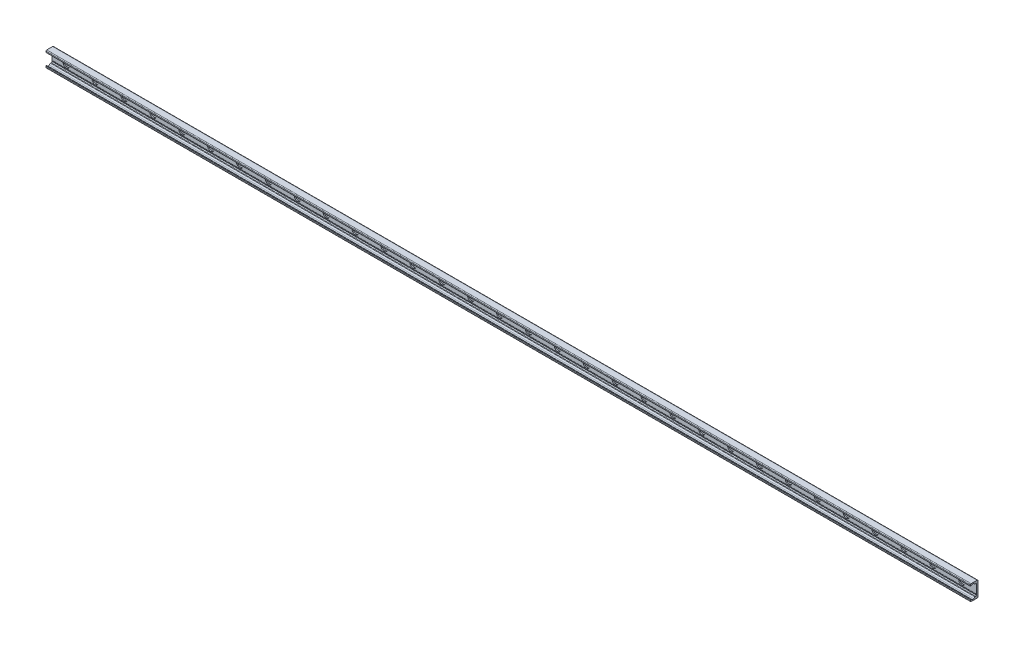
from build123d import *

# Parameters (mm, degrees)
BOSS_EXTRUDE1_DEPTH = 1280
SKETCH2_R           = 9
SKETCH2_R_2         = 4.5
CUT_EXTRUDE1_DEPTH  = 3.1
SKETCH2_2_R         = 4.5
CUT_EXTRUDE2_DEPTH  = 1281.286881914
LPATTERN1_COUNT     = 32
LPATTERN1_PITCH     = 80


with BuildPart() as part:
    # Sketch1 → Boss-Extrude1 (new, symmetric)
    with BuildSketch(Plane(origin=(0, 0, 0), x_dir=(0, 0, -1), z_dir=(1, 0, 0))):
        with BuildLine():
            Line((0, 0), (0, 19))
            ThreePointArc((0, 19), (-0.732233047, 20.767766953), (-2.5, 21.5))
            Line((-2.5, 21.5), (-19, 21.5))
            ThreePointArc((-19, 21.5), (-20.414213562, 20.914213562), (-21, 19.5))
            Line((-21, 19.5), (-21, 16.625057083))
            ThreePointArc((-21, 16.625057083), (-20.553251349, 15.888838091), (-19.693931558, 15.945160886))
            Line((-19.693931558, 15.945160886), (-16.794305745, 17.975500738))
            ThreePointArc((-16.794305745, 17.975500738), (-14.5, 18.69889256), (-12.205694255, 17.975500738))
            Line((-12.205694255, 17.975500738), (-8.829831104, 15.611695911))
            ThreePointArc((-8.829831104, 15.611695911), (-8.28408983, 15.342566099), (-7.682678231, 15.25))
            Line((-7.682678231, 15.25), (-6.5, 15.25))
            ThreePointArc((-6.5, 15.25), (-5.085786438, 14.664213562), (-4.5, 13.25))
            Line((-4.5, 13.25), (-4.5, -10.75))
            ThreePointArc((-4.5, -10.75), (-4.25, -11), (-4.5, -11.25))
            Line((-4.5, -11.25), (-4.5, -12.25))
            ThreePointArc((-4.5, -12.25), (-4.25, -12.5), (-4.5, -12.75))
            Line((-4.5, -12.75), (-4.5, -13.25))
            ThreePointArc((-4.5, -13.25), (-5.085786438, -14.664213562), (-6.5, -15.25))
            Line((-6.5, -15.25), (-7.682678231, -15.25))
            ThreePointArc((-7.682678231, -15.25), (-8.28408983, -15.342566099), (-8.829831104, -15.611695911))
            Line((-8.829831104, -15.611695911), (-12.205694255, -17.975500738))
            ThreePointArc((-12.205694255, -17.975500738), (-14.5, -18.69889256), (-16.794305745, -17.975500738))
            Line((-16.794305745, -17.975500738), (-19.693931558, -15.945160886))
            ThreePointArc((-19.693931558, -15.945160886), (-20.553251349, -15.888838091), (-21, -16.625057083))
            Line((-21, -16.625057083), (-21, -19.5))
            ThreePointArc((-21, -19.5), (-20.414213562, -20.914213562), (-19, -21.5))
            Line((-19, -21.5), (-2.5, -21.5))
            ThreePointArc((-2.5, -21.5), (-0.732233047, -20.767766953), (0, -19))
            Line((0, -19), (0, 0))
        make_face()
    extrude(amount=BOSS_EXTRUDE1_DEPTH, both=True)

    # Sketch2 → Cut-Extrude1 (cut)
    with BuildSketch(Plane.XY.offset(4.5)):
        with Locations((1240, 0)):
            Circle(SKETCH2_R)
        with Locations((1240, 0)):
            Circle(SKETCH2_R_2, mode=Mode.SUBTRACT)
    cut_extrude1 = extrude(amount=-CUT_EXTRUDE1_DEPTH, mode=Mode.SUBTRACT)

    # Sketch2_2 → Cut-Extrude2 (cut, through all)
    with BuildSketch(Plane.XY.offset(4.5)):
        with Locations((1240, 0)):
            Circle(SKETCH2_2_R)
    cut_extrude2 = extrude(amount=-CUT_EXTRUDE2_DEPTH, mode=Mode.SUBTRACT)

    # LPattern1: Cut-Extrude1, Cut-Extrude2 ×32
    with Locations(*[(-i * LPATTERN1_PITCH, 0, 0) for i in range(1, LPATTERN1_COUNT)]):
        add(cut_extrude1, mode=Mode.SUBTRACT)
        add(cut_extrude2, mode=Mode.SUBTRACT)


solid = part.part
